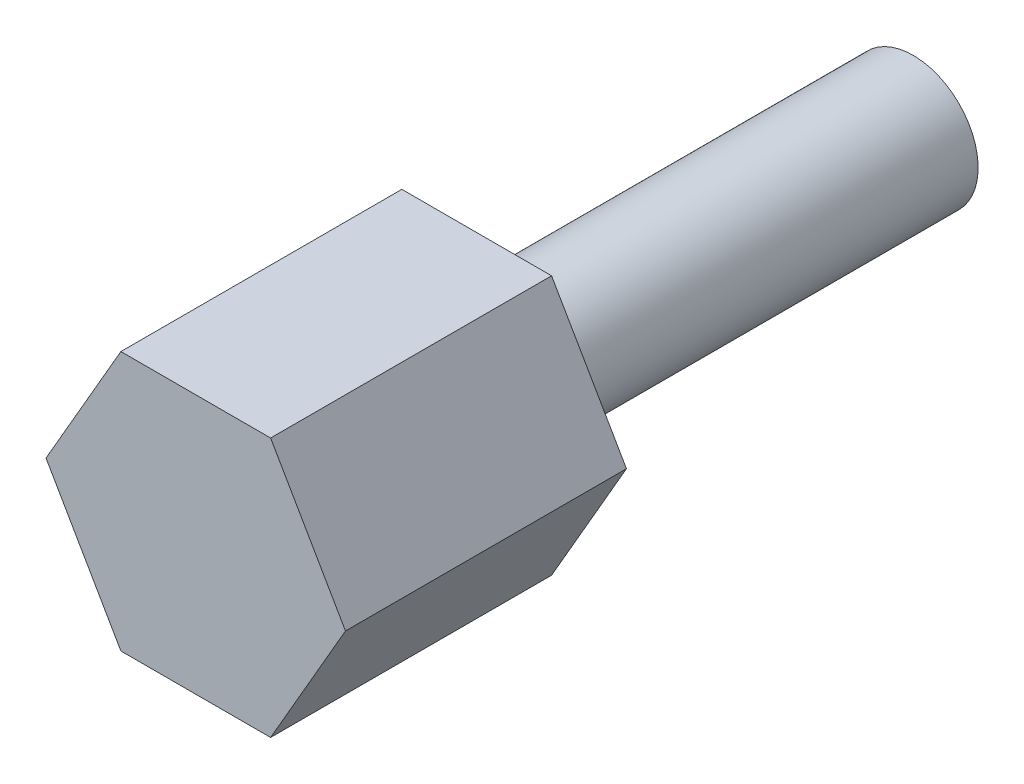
ISO-10303-21;
HEADER;
FILE_DESCRIPTION(('STEP AP214'),'2;1');
FILE_NAME('part.step','',(''),(''),'','','');
FILE_SCHEMA(('AUTOMOTIVE_DESIGN { 1 0 10303 214 1 1 1 1 }'));
ENDSEC;
DATA;
#1=APPLICATION_CONTEXT('core data for automotive mechanical design processes');
#2=APPLICATION_PROTOCOL_DEFINITION('international standard','automotive_design',2000,#1);
#3=PRODUCT_CONTEXT('',#1,'mechanical');
#4=PRODUCT('Part','Part','',(#3));
#5=PRODUCT_RELATED_PRODUCT_CATEGORY('part','',(#4));
#6=PRODUCT_DEFINITION_FORMATION('','',#4);
#7=PRODUCT_DEFINITION_CONTEXT('part definition',#1,'design');
#8=PRODUCT_DEFINITION('design','',#6,#7);
#9=PRODUCT_DEFINITION_SHAPE('','',#8);
#10=(LENGTH_UNIT() NAMED_UNIT(*) SI_UNIT(.MILLI.,.METRE.));
#11=(NAMED_UNIT(*) PLANE_ANGLE_UNIT() SI_UNIT($,.RADIAN.));
#12=(NAMED_UNIT(*) SI_UNIT($,.STERADIAN.) SOLID_ANGLE_UNIT());
#13=UNCERTAINTY_MEASURE_WITH_UNIT(LENGTH_MEASURE(1.E-05),#10,'distance_accuracy_value','');
#14=(GEOMETRIC_REPRESENTATION_CONTEXT(3) GLOBAL_UNCERTAINTY_ASSIGNED_CONTEXT((#13)) GLOBAL_UNIT_ASSIGNED_CONTEXT((#10,
#11,#12)) REPRESENTATION_CONTEXT('',''));
#15=CARTESIAN_POINT('',(0.,0.,0.));
#16=DIRECTION('',(0.,0.,1.));
#17=DIRECTION('',(1.,0.,0.));
#18=AXIS2_PLACEMENT_3D('',#15,#16,#17);
#19=CARTESIAN_POINT('',(-1.73205080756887,-3.,0.));
#20=DIRECTION('',(0.,0.,-1.));
#21=DIRECTION('',(-1.,0.,0.));
#22=AXIS2_PLACEMENT_3D('',#19,#20,#21);
#23=PLANE('',#22);
#24=DIRECTION('',(1.,0.,0.));
#25=VECTOR('',#24,1.);
#26=CARTESIAN_POINT('',(-1.73205080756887,-3.,0.));
#27=LINE('',#26,#25);
#28=CARTESIAN_POINT('',(-1.73205080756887,-3.,0.));
#29=VERTEX_POINT('',#28);
#30=CARTESIAN_POINT('',(1.73205080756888,-3.,0.));
#31=VERTEX_POINT('',#30);
#32=EDGE_CURVE('E87',#29,#31,#27,.T.);
#33=ORIENTED_EDGE('',*,*,#32,.F.);
#34=DIRECTION('',(0.5,-0.866025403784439,0.));
#35=VECTOR('',#34,1.);
#36=CARTESIAN_POINT('',(-3.46410161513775,0.,0.));
#37=LINE('',#36,#35);
#38=CARTESIAN_POINT('',(-3.46410161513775,0.,0.));
#39=VERTEX_POINT('',#38);
#40=EDGE_CURVE('E113',#39,#29,#37,.T.);
#41=ORIENTED_EDGE('',*,*,#40,.F.);
#42=DIRECTION('',(-0.5,-0.866025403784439,0.));
#43=VECTOR('',#42,1.);
#44=CARTESIAN_POINT('',(-1.73205080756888,3.,0.));
#45=LINE('',#44,#43);
#46=CARTESIAN_POINT('',(-1.73205080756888,3.,0.));
#47=VERTEX_POINT('',#46);
#48=EDGE_CURVE('E111',#47,#39,#45,.T.);
#49=ORIENTED_EDGE('',*,*,#48,.F.);
#50=DIRECTION('',(-1.,0.,0.));
#51=VECTOR('',#50,1.);
#52=CARTESIAN_POINT('',(1.73205080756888,3.,0.));
#53=LINE('',#52,#51);
#54=CARTESIAN_POINT('',(1.73205080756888,3.,0.));
#55=VERTEX_POINT('',#54);
#56=EDGE_CURVE('E109',#55,#47,#53,.T.);
#57=ORIENTED_EDGE('',*,*,#56,.F.);
#58=DIRECTION('',(-0.5,0.866025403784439,0.));
#59=VECTOR('',#58,1.);
#60=CARTESIAN_POINT('',(3.46410161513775,0.,0.));
#61=LINE('',#60,#59);
#62=CARTESIAN_POINT('',(3.46410161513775,0.,0.));
#63=VERTEX_POINT('',#62);
#64=EDGE_CURVE('E89',#63,#55,#61,.T.);
#65=ORIENTED_EDGE('',*,*,#64,.F.);
#66=DIRECTION('',(0.5,0.866025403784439,0.));
#67=VECTOR('',#66,1.);
#68=CARTESIAN_POINT('',(1.73205080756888,-3.,0.));
#69=LINE('',#68,#67);
#70=EDGE_CURVE('E83',#31,#63,#69,.T.);
#71=ORIENTED_EDGE('',*,*,#70,.F.);
#72=EDGE_LOOP('',(#33,#41,#49,#57,#65,#71));
#73=FACE_BOUND('',#72,.T.);
#74=CARTESIAN_POINT('',(0.,0.,0.));
#75=DIRECTION('',(0.,0.,-1.));
#76=DIRECTION('',(-1.,0.,0.));
#77=AXIS2_PLACEMENT_3D('',#74,#75,#76);
#78=CIRCLE('',#77,1.5);
#79=CARTESIAN_POINT('',(-1.5,0.,0.));
#80=VERTEX_POINT('',#79);
#81=EDGE_CURVE('E104',#80,#80,#78,.T.);
#82=ORIENTED_EDGE('',*,*,#81,.F.);
#83=EDGE_LOOP('',(#82));
#84=FACE_BOUND('',#83,.T.);
#85=ADVANCED_FACE('F30',(#73,#84),#23,.T.);
#86=CARTESIAN_POINT('',(-1.73205080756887,-3.,6.5));
#87=DIRECTION('',(0.,1.,0.));
#88=DIRECTION('',(-1.,0.,0.));
#89=AXIS2_PLACEMENT_3D('',#86,#87,#88);
#90=PLANE('',#89);
#91=ORIENTED_EDGE('',*,*,#32,.T.);
#92=DIRECTION('',(0.,0.,-1.));
#93=VECTOR('',#92,1.);
#94=CARTESIAN_POINT('',(1.73205080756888,-3.,6.5));
#95=LINE('',#94,#93);
#96=CARTESIAN_POINT('',(1.73205080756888,-3.,6.5));
#97=VERTEX_POINT('',#96);
#98=EDGE_CURVE('E11',#97,#31,#95,.T.);
#99=ORIENTED_EDGE('',*,*,#98,.F.);
#100=DIRECTION('',(1.,0.,0.));
#101=VECTOR('',#100,1.);
#102=CARTESIAN_POINT('',(-1.73205080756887,-3.,6.5));
#103=LINE('',#102,#101);
#104=CARTESIAN_POINT('',(-1.73205080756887,-3.,6.5));
#105=VERTEX_POINT('',#104);
#106=EDGE_CURVE('E115',#105,#97,#103,.T.);
#107=ORIENTED_EDGE('',*,*,#106,.F.);
#108=DIRECTION('',(0.,0.,-1.));
#109=VECTOR('',#108,1.);
#110=CARTESIAN_POINT('',(-1.73205080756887,-3.,6.5));
#111=LINE('',#110,#109);
#112=EDGE_CURVE('E100',#105,#29,#111,.T.);
#113=ORIENTED_EDGE('',*,*,#112,.T.);
#114=EDGE_LOOP('',(#91,#99,#107,#113));
#115=FACE_BOUND('',#114,.T.);
#116=ADVANCED_FACE('F32',(#115),#90,.F.);
#117=CARTESIAN_POINT('',(1.73205080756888,-3.,6.5));
#118=DIRECTION('',(-0.866025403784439,0.5,0.));
#119=DIRECTION('',(-0.5,-0.866025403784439,0.));
#120=AXIS2_PLACEMENT_3D('',#117,#118,#119);
#121=PLANE('',#120);
#122=ORIENTED_EDGE('',*,*,#70,.T.);
#123=DIRECTION('',(0.,0.,-1.));
#124=VECTOR('',#123,1.);
#125=CARTESIAN_POINT('',(3.46410161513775,0.,6.5));
#126=LINE('',#125,#124);
#127=CARTESIAN_POINT('',(3.46410161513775,0.,6.5));
#128=VERTEX_POINT('',#127);
#129=EDGE_CURVE('E38',#128,#63,#126,.T.);
#130=ORIENTED_EDGE('',*,*,#129,.F.);
#131=DIRECTION('',(0.5,0.866025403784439,0.));
#132=VECTOR('',#131,1.);
#133=CARTESIAN_POINT('',(1.73205080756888,-3.,6.5));
#134=LINE('',#133,#132);
#135=EDGE_CURVE('E96',#97,#128,#134,.T.);
#136=ORIENTED_EDGE('',*,*,#135,.F.);
#137=ORIENTED_EDGE('',*,*,#98,.T.);
#138=EDGE_LOOP('',(#122,#130,#136,#137));
#139=FACE_BOUND('',#138,.T.);
#140=ADVANCED_FACE('F95',(#139),#121,.F.);
#141=CARTESIAN_POINT('',(3.46410161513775,0.,6.5));
#142=DIRECTION('',(-0.866025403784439,-0.5,0.));
#143=DIRECTION('',(0.5,-0.866025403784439,0.));
#144=AXIS2_PLACEMENT_3D('',#141,#142,#143);
#145=PLANE('',#144);
#146=ORIENTED_EDGE('',*,*,#64,.T.);
#147=DIRECTION('',(0.,0.,-1.));
#148=VECTOR('',#147,1.);
#149=CARTESIAN_POINT('',(1.73205080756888,3.,6.5));
#150=LINE('',#149,#148);
#151=CARTESIAN_POINT('',(1.73205080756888,3.,6.5));
#152=VERTEX_POINT('',#151);
#153=EDGE_CURVE('E131',#152,#55,#150,.T.);
#154=ORIENTED_EDGE('',*,*,#153,.F.);
#155=DIRECTION('',(-0.5,0.866025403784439,0.));
#156=VECTOR('',#155,1.);
#157=CARTESIAN_POINT('',(3.46410161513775,0.,6.5));
#158=LINE('',#157,#156);
#159=EDGE_CURVE('E118',#128,#152,#158,.T.);
#160=ORIENTED_EDGE('',*,*,#159,.F.);
#161=ORIENTED_EDGE('',*,*,#129,.T.);
#162=EDGE_LOOP('',(#146,#154,#160,#161));
#163=FACE_BOUND('',#162,.T.);
#164=ADVANCED_FACE('F135',(#163),#145,.F.);
#165=CARTESIAN_POINT('',(1.73205080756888,3.,6.5));
#166=DIRECTION('',(0.,-1.,0.));
#167=DIRECTION('',(0.,0.,-1.));
#168=AXIS2_PLACEMENT_3D('',#165,#166,#167);
#169=PLANE('',#168);
#170=ORIENTED_EDGE('',*,*,#56,.T.);
#171=DIRECTION('',(0.,0.,-1.));
#172=VECTOR('',#171,1.);
#173=CARTESIAN_POINT('',(-1.73205080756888,3.,6.5));
#174=LINE('',#173,#172);
#175=CARTESIAN_POINT('',(-1.73205080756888,3.,6.5));
#176=VERTEX_POINT('',#175);
#177=EDGE_CURVE('E128',#176,#47,#174,.T.);
#178=ORIENTED_EDGE('',*,*,#177,.F.);
#179=DIRECTION('',(-1.,0.,0.));
#180=VECTOR('',#179,1.);
#181=CARTESIAN_POINT('',(1.73205080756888,3.,6.5));
#182=LINE('',#181,#180);
#183=EDGE_CURVE('E120',#152,#176,#182,.T.);
#184=ORIENTED_EDGE('',*,*,#183,.F.);
#185=ORIENTED_EDGE('',*,*,#153,.T.);
#186=EDGE_LOOP('',(#170,#178,#184,#185));
#187=FACE_BOUND('',#186,.T.);
#188=ADVANCED_FACE('F141',(#187),#169,.F.);
#189=CARTESIAN_POINT('',(-1.73205080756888,3.,6.5));
#190=DIRECTION('',(0.866025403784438,-0.5,0.));
#191=DIRECTION('',(0.5,0.866025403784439,0.));
#192=AXIS2_PLACEMENT_3D('',#189,#190,#191);
#193=PLANE('',#192);
#194=ORIENTED_EDGE('',*,*,#48,.T.);
#195=DIRECTION('',(0.,0.,-1.));
#196=VECTOR('',#195,1.);
#197=CARTESIAN_POINT('',(-3.46410161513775,0.,6.5));
#198=LINE('',#197,#196);
#199=CARTESIAN_POINT('',(-3.46410161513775,0.,6.5));
#200=VERTEX_POINT('',#199);
#201=EDGE_CURVE('E125',#200,#39,#198,.T.);
#202=ORIENTED_EDGE('',*,*,#201,.F.);
#203=DIRECTION('',(-0.5,-0.866025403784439,0.));
#204=VECTOR('',#203,1.);
#205=CARTESIAN_POINT('',(-1.73205080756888,3.,6.5));
#206=LINE('',#205,#204);
#207=EDGE_CURVE('E50',#176,#200,#206,.T.);
#208=ORIENTED_EDGE('',*,*,#207,.F.);
#209=ORIENTED_EDGE('',*,*,#177,.T.);
#210=EDGE_LOOP('',(#194,#202,#208,#209));
#211=FACE_BOUND('',#210,.T.);
#212=ADVANCED_FACE('F144',(#211),#193,.F.);
#213=CARTESIAN_POINT('',(-3.46410161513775,0.,6.5));
#214=DIRECTION('',(0.866025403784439,0.5,0.));
#215=DIRECTION('',(-0.5,0.866025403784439,0.));
#216=AXIS2_PLACEMENT_3D('',#213,#214,#215);
#217=PLANE('',#216);
#218=ORIENTED_EDGE('',*,*,#40,.T.);
#219=ORIENTED_EDGE('',*,*,#112,.F.);
#220=DIRECTION('',(0.5,-0.866025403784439,0.));
#221=VECTOR('',#220,1.);
#222=CARTESIAN_POINT('',(-3.46410161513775,0.,6.5));
#223=LINE('',#222,#221);
#224=EDGE_CURVE('E45',#200,#105,#223,.T.);
#225=ORIENTED_EDGE('',*,*,#224,.F.);
#226=ORIENTED_EDGE('',*,*,#201,.T.);
#227=EDGE_LOOP('',(#218,#219,#225,#226));
#228=FACE_BOUND('',#227,.T.);
#229=ADVANCED_FACE('F146',(#228),#217,.F.);
#230=CARTESIAN_POINT('',(-1.73205080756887,-3.,6.5));
#231=DIRECTION('',(0.,0.,-1.));
#232=DIRECTION('',(-1.,0.,0.));
#233=AXIS2_PLACEMENT_3D('',#230,#231,#232);
#234=PLANE('',#233);
#235=ORIENTED_EDGE('',*,*,#106,.T.);
#236=ORIENTED_EDGE('',*,*,#135,.T.);
#237=ORIENTED_EDGE('',*,*,#159,.T.);
#238=ORIENTED_EDGE('',*,*,#183,.T.);
#239=ORIENTED_EDGE('',*,*,#207,.T.);
#240=ORIENTED_EDGE('',*,*,#224,.T.);
#241=EDGE_LOOP('',(#235,#236,#237,#238,#239,#240));
#242=FACE_BOUND('',#241,.T.);
#243=ADVANCED_FACE('F138',(#242),#234,.F.);
#244=CARTESIAN_POINT('',(0.,0.,-10.1));
#245=DIRECTION('',(0.,0.,1.));
#246=DIRECTION('',(1.,0.,0.));
#247=AXIS2_PLACEMENT_3D('',#244,#245,#246);
#248=CYLINDRICAL_SURFACE('',#247,1.5);
#249=CARTESIAN_POINT('',(0.,0.,-10.1));
#250=DIRECTION('',(0.,0.,-1.));
#251=DIRECTION('',(-1.,0.,0.));
#252=AXIS2_PLACEMENT_3D('',#249,#250,#251);
#253=CIRCLE('',#252,1.5);
#254=CARTESIAN_POINT('',(-1.5,0.,-10.1));
#255=VERTEX_POINT('',#254);
#256=EDGE_CURVE('E101',#255,#255,#253,.T.);
#257=ORIENTED_EDGE('',*,*,#256,.F.);
#258=EDGE_LOOP('',(#257));
#259=FACE_BOUND('',#258,.T.);
#260=ORIENTED_EDGE('',*,*,#81,.T.);
#261=EDGE_LOOP('',(#260));
#262=FACE_BOUND('',#261,.T.);
#263=ADVANCED_FACE('F153',(#259,#262),#248,.T.);
#264=CARTESIAN_POINT('',(0.,0.,-10.1));
#265=DIRECTION('',(0.,0.,-1.));
#266=DIRECTION('',(-1.,0.,0.));
#267=AXIS2_PLACEMENT_3D('',#264,#265,#266);
#268=PLANE('',#267);
#269=ORIENTED_EDGE('',*,*,#256,.T.);
#270=EDGE_LOOP('',(#269));
#271=FACE_BOUND('',#270,.T.);
#272=ADVANCED_FACE('F164',(#271),#268,.T.);
#273=CLOSED_SHELL('',(#85,#116,#140,#164,#188,#212,#229,#243,#263,#272));
#274=MANIFOLD_SOLID_BREP('B2',#273);
#275=ADVANCED_BREP_SHAPE_REPRESENTATION('',(#18,#274),#14);
#276=SHAPE_DEFINITION_REPRESENTATION(#9,#275);
ENDSEC;
END-ISO-10303-21;
